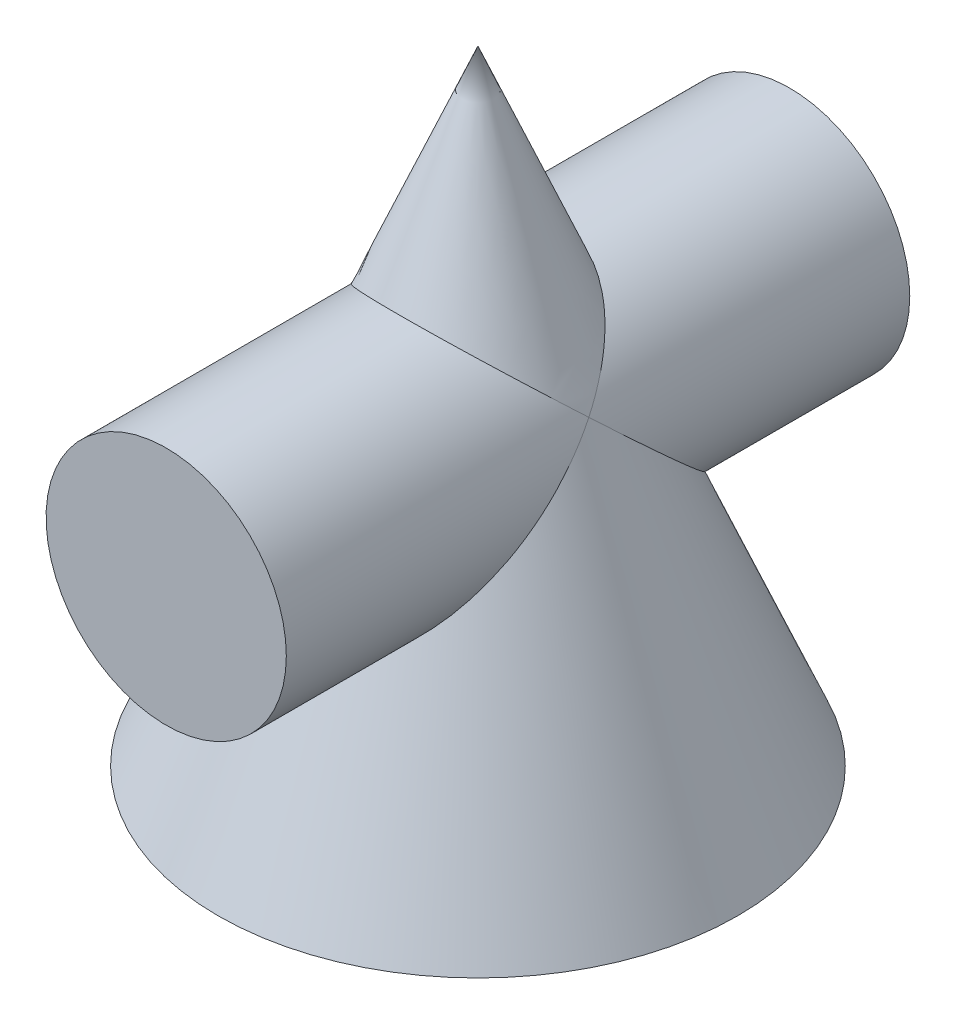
ISO-10303-21;
HEADER;
FILE_DESCRIPTION(('STEP AP214'),'2;1');
FILE_NAME('part.step','',(''),(''),'','','');
FILE_SCHEMA(('AUTOMOTIVE_DESIGN { 1 0 10303 214 1 1 1 1 }'));
ENDSEC;
DATA;
#1=APPLICATION_CONTEXT('core data for automotive mechanical design processes');
#2=APPLICATION_PROTOCOL_DEFINITION('international standard','automotive_design',2000,#1);
#3=PRODUCT_CONTEXT('',#1,'mechanical');
#4=PRODUCT('Part','Part','',(#3));
#5=PRODUCT_RELATED_PRODUCT_CATEGORY('part','',(#4));
#6=PRODUCT_DEFINITION_FORMATION('','',#4);
#7=PRODUCT_DEFINITION_CONTEXT('part definition',#1,'design');
#8=PRODUCT_DEFINITION('design','',#6,#7);
#9=PRODUCT_DEFINITION_SHAPE('','',#8);
#10=(LENGTH_UNIT() NAMED_UNIT(*) SI_UNIT(.MILLI.,.METRE.));
#11=(NAMED_UNIT(*) PLANE_ANGLE_UNIT() SI_UNIT($,.RADIAN.));
#12=(NAMED_UNIT(*) SI_UNIT($,.STERADIAN.) SOLID_ANGLE_UNIT());
#13=UNCERTAINTY_MEASURE_WITH_UNIT(LENGTH_MEASURE(1.E-05),#10,'distance_accuracy_value','');
#14=(GEOMETRIC_REPRESENTATION_CONTEXT(3) GLOBAL_UNCERTAINTY_ASSIGNED_CONTEXT((#13)) GLOBAL_UNIT_ASSIGNED_CONTEXT((#10,
#11,#12)) REPRESENTATION_CONTEXT('',''));
#15=CARTESIAN_POINT('',(0.,0.,0.));
#16=DIRECTION('',(0.,0.,1.));
#17=DIRECTION('',(1.,0.,0.));
#18=AXIS2_PLACEMENT_3D('',#15,#16,#17);
#19=CARTESIAN_POINT('',(0.,60.5117647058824,0.));
#20=DIRECTION('',(0.,-1.,0.));
#21=DIRECTION('',(0.,0.,-1.));
#22=AXIS2_PLACEMENT_3D('',#19,#20,#21);
#23=CONICAL_SURFACE('',#22,0.,0.394791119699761);
#24=CARTESIAN_POINT('',(0.,0.511764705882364,0.));
#25=DIRECTION('',(0.,1.,0.));
#26=DIRECTION('',(0.,0.,1.));
#27=AXIS2_PLACEMENT_3D('',#24,#25,#26);
#28=CIRCLE('',#27,25.);
#29=CARTESIAN_POINT('',(0.,0.511764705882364,25.));
#30=VERTEX_POINT('',#29);
#31=EDGE_CURVE('E66',#30,#30,#28,.T.);
#32=ORIENTED_EDGE('',*,*,#31,.T.);
#33=EDGE_LOOP('',(#32));
#34=FACE_BOUND('',#33,.T.);
#35=CARTESIAN_POINT('',(-10.6713621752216,34.9004954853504,0.));
#36=CARTESIAN_POINT('',(-10.6733116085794,34.8958168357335,0.00506853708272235));
#37=CARTESIAN_POINT('',(-10.6752577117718,34.891137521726,0.010137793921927));
#38=CARTESIAN_POINT('',(-10.854043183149,34.4604587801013,0.476706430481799));
#39=CARTESIAN_POINT('',(-11.003304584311,34.0289784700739,0.944143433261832));
#40=CARTESIAN_POINT('',(-11.24885767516,33.158946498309,1.88667806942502));
#41=CARTESIAN_POINT('',(-11.3451043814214,32.7203891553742,2.3617818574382));
#42=CARTESIAN_POINT('',(-11.4862680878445,31.8377644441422,3.31795862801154));
#43=CARTESIAN_POINT('',(-11.5309852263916,31.393682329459,3.79904758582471));
#44=CARTESIAN_POINT('',(-11.5690895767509,30.5046335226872,4.76218379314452));
#45=CARTESIAN_POINT('',(-11.5624890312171,30.0596670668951,5.24423078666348));
#46=CARTESIAN_POINT('',(-11.4965350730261,29.1527730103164,6.22669934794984));
#47=CARTESIAN_POINT('',(-11.434978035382,28.6909178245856,6.72704246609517));
#48=CARTESIAN_POINT('',(-11.2549932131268,27.7721603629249,7.72236304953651));
#49=CARTESIAN_POINT('',(-11.1365496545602,27.3152594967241,8.21733898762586));
#50=CARTESIAN_POINT('',(-10.841161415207,26.4114239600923,9.1964941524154));
#51=CARTESIAN_POINT('',(-10.6643679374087,25.9644666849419,9.68069786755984));
#52=CARTESIAN_POINT('',(-10.2492533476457,25.0839936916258,10.6345436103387));
#53=CARTESIAN_POINT('',(-10.0109729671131,24.6504692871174,11.1041950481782));
#54=CARTESIAN_POINT('',(-9.5777622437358,23.9729271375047,11.8381990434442));
#55=CARTESIAN_POINT('',(-9.40381407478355,23.7226817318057,12.1092982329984));
#56=CARTESIAN_POINT('',(-9.03139483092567,23.2306917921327,12.6422873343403));
#57=CARTESIAN_POINT('',(-8.83292564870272,22.9889466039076,12.9041779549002));
#58=CARTESIAN_POINT('',(-8.41059800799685,22.5161682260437,13.4163545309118));
#59=CARTESIAN_POINT('',(-8.18676434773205,22.2851248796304,13.6666514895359));
#60=CARTESIAN_POINT('',(-7.71249322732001,21.8359437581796,14.1532643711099));
#61=CARTESIAN_POINT('',(-7.46206238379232,21.6178027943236,14.3895837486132));
#62=CARTESIAN_POINT('',(-6.99738220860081,21.2480779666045,14.7901189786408));
#63=CARTESIAN_POINT('',(-6.78895577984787,21.0931224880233,14.9579874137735));
#64=CARTESIAN_POINT('',(-6.35597306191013,20.7939033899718,15.2821414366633));
#65=CARTESIAN_POINT('',(-6.13141736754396,20.6496393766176,15.438427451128));
#66=CARTESIAN_POINT('',(-5.66638982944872,20.3737427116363,15.7373155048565));
#67=CARTESIAN_POINT('',(-5.42593492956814,20.2420969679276,15.8799317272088));
#68=CARTESIAN_POINT('',(-4.92922616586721,19.9932973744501,16.1494646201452));
#69=CARTESIAN_POINT('',(-4.67297599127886,19.8761401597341,16.2763849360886));
#70=CARTESIAN_POINT('',(-4.20066157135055,19.681266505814,16.487498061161));
#71=CARTESIAN_POINT('',(-3.98739500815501,19.6004249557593,16.5750764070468));
#72=CARTESIAN_POINT('',(-3.55220457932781,19.4503113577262,16.7376994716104));
#73=CARTESIAN_POINT('',(-3.33028268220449,19.3810366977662,16.8127470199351));
#74=CARTESIAN_POINT('',(-2.8788434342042,19.2551844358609,16.9490869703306));
#75=CARTESIAN_POINT('',(-2.64932976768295,19.1986007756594,17.0103859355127));
#76=CARTESIAN_POINT('',(-2.18391563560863,19.0991141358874,17.1181631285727));
#77=CARTESIAN_POINT('',(-1.94801510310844,19.0562112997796,17.1646412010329));
#78=CARTESIAN_POINT('',(-1.46999800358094,18.9847306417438,17.242078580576));
#79=CARTESIAN_POINT('',(-1.22785212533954,18.9562425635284,17.2729406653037));
#80=CARTESIAN_POINT('',(-0.740695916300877,18.9146154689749,17.3180366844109));
#81=CARTESIAN_POINT('',(-0.495685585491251,18.9014764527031,17.3322706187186));
#82=CARTESIAN_POINT('',(-0.0049741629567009,18.8908491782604,17.3437834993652));
#83=CARTESIAN_POINT('',(0.240726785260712,18.893357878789,17.3410657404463));
#84=CARTESIAN_POINT('',(0.73069087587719,18.9139621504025,17.318744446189));
#85=CARTESIAN_POINT('',(0.974954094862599,18.9320568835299,17.2991418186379));
#86=CARTESIAN_POINT('',(1.43699237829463,18.9809839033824,17.2461375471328));
#87=CARTESIAN_POINT('',(1.65508617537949,19.0104483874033,17.2142176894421));
#88=CARTESIAN_POINT('',(2.08709822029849,19.0813023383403,17.137459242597));
#89=CARTESIAN_POINT('',(2.30101487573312,19.1226962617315,17.0926158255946));
#90=CARTESIAN_POINT('',(2.72338185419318,19.2167258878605,16.990750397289));
#91=CARTESIAN_POINT('',(2.93183238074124,19.2693611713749,16.9337288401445));
#92=CARTESIAN_POINT('',(3.34233525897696,19.3850951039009,16.8083504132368));
#93=CARTESIAN_POINT('',(3.54438633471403,19.4481958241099,16.7399912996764));
#94=CARTESIAN_POINT('',(4.00630822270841,19.6062632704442,16.5687515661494));
#95=CARTESIAN_POINT('',(4.26345988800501,19.70490021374,16.4618948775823));
#96=CARTESIAN_POINT('',(4.76394851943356,19.9171501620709,16.231957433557));
#97=CARTESIAN_POINT('',(5.00728175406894,20.0307671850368,16.1088723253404));
#98=CARTESIAN_POINT('',(5.47980173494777,20.2712363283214,15.8483640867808));
#99=CARTESIAN_POINT('',(5.70896712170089,20.3981076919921,15.7109201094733));
#100=CARTESIAN_POINT('',(6.15250743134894,20.6631867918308,15.4237510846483));
#101=CARTESIAN_POINT('',(6.36688156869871,20.8013951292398,15.2740253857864));
#102=CARTESIAN_POINT('',(6.86296272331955,21.1443317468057,14.9025107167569));
#103=CARTESIAN_POINT('',(7.13768945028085,21.3537174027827,14.6756762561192));
#104=CARTESIAN_POINT('',(7.65910917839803,21.787970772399,14.2052351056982));
#105=CARTESIAN_POINT('',(7.90579145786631,22.0128443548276,13.9616220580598));
#106=CARTESIAN_POINT('',(8.37239221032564,22.4754013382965,13.460518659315));
#107=CARTESIAN_POINT('',(8.59227558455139,22.7131009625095,13.2030107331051));
#108=CARTESIAN_POINT('',(9.00602244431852,23.1986315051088,12.6770193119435));
#109=CARTESIAN_POINT('',(9.19988587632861,23.4464624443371,12.4085357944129));
#110=CARTESIAN_POINT('',(9.64031046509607,24.0580535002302,11.7459788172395));
#111=CARTESIAN_POINT('',(9.87399064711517,24.4260980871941,11.3472638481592));
#112=CARTESIAN_POINT('',(10.2936283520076,25.1745294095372,10.5364632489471));
#113=CARTESIAN_POINT('',(10.4795656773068,25.5549212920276,10.124372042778));
#114=CARTESIAN_POINT('',(10.8062080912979,26.3249988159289,9.29012139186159));
#115=CARTESIAN_POINT('',(10.9468572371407,26.7146953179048,8.86795018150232));
#116=CARTESIAN_POINT('',(11.1843863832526,27.5000744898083,8.01712274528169));
#117=CARTESIAN_POINT('',(11.2812727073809,27.8957562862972,7.58846746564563));
#118=CARTESIAN_POINT('',(11.434750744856,28.702418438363,6.71458346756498));
#119=CARTESIAN_POINT('',(11.4900850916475,29.1135084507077,6.26923595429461));
#120=CARTESIAN_POINT('',(11.556482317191,29.9373876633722,5.37670014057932));
#121=CARTESIAN_POINT('',(11.5675378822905,30.3501771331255,4.92951154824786));
#122=CARTESIAN_POINT('',(11.5455299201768,31.1743757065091,4.0366297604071));
#123=CARTESIAN_POINT('',(11.5125553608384,31.5857859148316,3.59093536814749));
#124=CARTESIAN_POINT('',(11.4022206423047,32.4057208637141,2.70267250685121));
#125=CARTESIAN_POINT('',(11.3248808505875,32.814246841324,2.26010269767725));
#126=CARTESIAN_POINT('',(11.1556392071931,33.5010323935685,1.51608501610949));
#127=CARTESIAN_POINT('',(11.0755600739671,33.7806579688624,1.21315730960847));
#128=CARTESIAN_POINT('',(10.8931838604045,34.3364213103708,0.61108035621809));
#129=CARTESIAN_POINT('',(10.7909015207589,34.6125612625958,0.311928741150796));
#130=CARTESIAN_POINT('',(10.6752577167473,34.8911375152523,0.0101378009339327));
#131=CARTESIAN_POINT('',(10.6733116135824,34.8958168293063,0.00506854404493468));
#132=CARTESIAN_POINT('',(10.6713621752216,34.9004954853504,0.));
#133=B_SPLINE_CURVE_WITH_KNOTS('',3,(#35,#36,#37,#38,#39,#40,#41,#42,#43,#44,#45,#46,#47,#48,
#49,#50,#51,#52,#53,#54,#55,#56,#57,#58,#59,#60,#61,#62,#63,#64,#65,#66,#67,#68,#69,#70,#71,#72,
#73,#74,#75,#76,#77,#78,#79,#80,#81,#82,#83,#84,#85,#86,#87,#88,#89,#90,#91,#92,#93,#94,#95,#96,
#97,#98,#99,#100,#101,#102,#103,#104,#105,#106,#107,#108,#109,#110,#111,#112,#113,#114,#115,
#116,#117,#118,#119,#120,#121,#122,#123,#124,#125,#126,#127,#128,#129,#130,#131,#132),
.UNSPECIFIED.,.F.,.F.,(4,2,2,2,2,2,2,2,2,2,2,2,2,2,2,2,2,2,2,2,2,2,2,2,2,2,2,2,2,2,2,2,2,2,2,2,
2,2,2,2,2,2,2,2,2,2,2,2,4),(0.,0.0215040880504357,1.97893203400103,3.93801832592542,
5.90467778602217,7.87086808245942,9.91962510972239,11.9689505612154,14.0130067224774,
16.0557122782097,17.2786045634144,18.5014025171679,19.7230151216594,20.9443245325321,
21.8713363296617,22.7983139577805,23.7243191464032,24.6501088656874,25.3823632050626,
26.1144519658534,26.8461905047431,27.5779367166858,28.3141842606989,29.0504318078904,
29.7865362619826,30.5226011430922,31.1889934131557,31.8556349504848,32.5222516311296,
33.1890003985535,34.0739649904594,34.9591674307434,35.8456734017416,36.7322264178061,
37.970086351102,39.2084179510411,40.4483543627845,41.6882933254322,43.4580812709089,
45.2286166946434,47.0013308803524,48.7737888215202,50.5979313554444,52.422375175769,
54.2431380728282,56.0630657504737,57.3224310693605,58.5809628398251,58.6024669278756),.UNSPECIFIED.);
#134=CARTESIAN_POINT('',(10.6713621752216,34.9004954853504,0.));
#135=VERTEX_POINT('',#134);
#136=CARTESIAN_POINT('',(-10.6713621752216,34.9004954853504,0.));
#137=VERTEX_POINT('',#136);
#138=EDGE_CURVE('E47',#135,#137,#133,.F.);
#139=ORIENTED_EDGE('',*,*,#138,.T.);
#140=CARTESIAN_POINT('',(-10.6713621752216,34.9004954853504,0.));
#141=CARTESIAN_POINT('',(-10.6733116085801,34.8958168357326,-0.00506853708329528));
#142=CARTESIAN_POINT('',(-10.6752577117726,34.8911375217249,-0.0101377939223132));
#143=CARTESIAN_POINT('',(-10.8540343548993,34.4604800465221,-0.476683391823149));
#144=CARTESIAN_POINT('',(-11.0032896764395,34.0290215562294,-0.944096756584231));
#145=CARTESIAN_POINT('',(-11.2488358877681,33.1590334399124,-1.88658388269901));
#146=CARTESIAN_POINT('',(-11.3450817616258,32.7204981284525,-2.36166380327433));
#147=CARTESIAN_POINT('',(-11.4862559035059,31.837873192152,-3.3178408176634));
#148=CARTESIAN_POINT('',(-11.5309791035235,31.3937684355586,-3.79895430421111));
#149=CARTESIAN_POINT('',(-11.5690901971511,30.5046757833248,-4.76213801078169));
#150=CARTESIAN_POINT('',(-11.5624905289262,30.0596881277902,-5.24420797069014));
#151=CARTESIAN_POINT('',(-11.4965260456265,29.1526483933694,-6.22683434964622));
#152=CARTESIAN_POINT('',(-11.4349450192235,28.6906691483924,-6.72731186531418));
#153=CARTESIAN_POINT('',(-11.2548792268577,27.7716587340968,-7.72290648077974));
#154=CARTESIAN_POINT('',(-11.1363777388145,27.3146290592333,-8.21802196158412));
#155=CARTESIAN_POINT('',(-10.8409190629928,26.4107866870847,-9.19718453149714));
#156=CARTESIAN_POINT('',(-10.6641443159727,25.9639466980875,-9.68126118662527));
#157=CARTESIAN_POINT('',(-10.2491032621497,25.0837210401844,-10.6348389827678));
#158=CARTESIAN_POINT('',(-10.0108816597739,24.6503258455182,-11.1043504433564));
#159=CARTESIAN_POINT('',(-9.59327362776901,23.9971873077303,-11.8119171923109));
#160=CARTESIAN_POINT('',(-9.43697409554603,23.7705747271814,-12.0574141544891));
#161=CARTESIAN_POINT('',(-9.10442870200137,23.3242082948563,-12.5409777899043));
#162=CARTESIAN_POINT('',(-8.92818781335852,23.1044527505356,-12.7790462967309));
#163=CARTESIAN_POINT('',(-8.55503764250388,22.6732825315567,-13.2461473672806));
#164=CARTESIAN_POINT('',(-8.35813790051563,22.4618640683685,-13.4751840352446));
#165=CARTESIAN_POINT('',(-7.94279917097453,22.0489698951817,-13.9224860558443));
#166=CARTESIAN_POINT('',(-7.72436253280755,21.84749310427,-14.1407525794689));
#167=CARTESIAN_POINT('',(-7.30355968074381,21.489187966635,-14.5289164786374));
#168=CARTESIAN_POINT('',(-7.10459756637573,21.330520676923,-14.7008060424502));
#169=CARTESIAN_POINT('',(-6.69087703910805,21.0229201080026,-15.0340399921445));
#170=CARTESIAN_POINT('',(-6.47611886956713,20.873986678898,-15.1953845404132));
#171=CARTESIAN_POINT('',(-6.0307825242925,20.5875774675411,-15.5056611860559));
#172=CARTESIAN_POINT('',(-5.80021386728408,20.4500948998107,-15.6546006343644));
#173=CARTESIAN_POINT('',(-5.32329498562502,20.188378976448,-15.9381262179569));
#174=CARTESIAN_POINT('',(-5.07694959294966,20.0641415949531,-16.072716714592));
#175=CARTESIAN_POINT('',(-4.61422639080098,19.8517301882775,-16.3028290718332));
#176=CARTESIAN_POINT('',(-4.40032400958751,19.7610738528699,-16.4010401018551));
#177=CARTESIAN_POINT('',(-3.96285757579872,19.5913504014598,-16.5849071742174));
#178=CARTESIAN_POINT('',(-3.73929887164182,19.5122769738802,-16.6705700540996));
#179=CARTESIAN_POINT('',(-3.28336166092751,19.366930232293,-16.8280290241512));
#180=CARTESIAN_POINT('',(-3.05098582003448,19.3006530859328,-16.8998292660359));
#181=CARTESIAN_POINT('',(-2.57857924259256,19.1820638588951,-17.0283009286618));
#182=CARTESIAN_POINT('',(-2.33854847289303,19.1297518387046,-17.0849722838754));
#183=CARTESIAN_POINT('',(-1.8506027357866,19.0398176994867,-17.1824009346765));
#184=CARTESIAN_POINT('',(-1.60264195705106,19.002309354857,-17.2230349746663));
#185=CARTESIAN_POINT('',(-1.10257519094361,18.94339720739,-17.2868564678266));
#186=CARTESIAN_POINT('',(-0.850469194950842,18.9219934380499,-17.3100438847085));
#187=CARTESIAN_POINT('',(-0.344480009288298,18.895810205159,-17.3384090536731));
#188=CARTESIAN_POINT('',(-0.0905975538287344,18.8910242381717,-17.3435938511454));
#189=CARTESIAN_POINT('',(0.416640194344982,18.8981791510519,-17.3358426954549));
#190=CARTESIAN_POINT('',(0.669995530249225,18.910118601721,-17.3229082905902));
#191=CARTESIAN_POINT('',(1.14370249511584,18.9480117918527,-17.2818573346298));
#192=CARTESIAN_POINT('',(1.36438082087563,18.972120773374,-17.2557392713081));
#193=CARTESIAN_POINT('',(1.80211913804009,19.0326388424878,-17.1901780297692));
#194=CARTESIAN_POINT('',(2.01917776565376,19.0690524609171,-17.1507299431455));
#195=CARTESIAN_POINT('',(2.44826753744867,19.1535523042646,-17.0591884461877));
#196=CARTESIAN_POINT('',(2.66029897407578,19.2016378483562,-17.0070957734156));
#197=CARTESIAN_POINT('',(3.0782949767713,19.3087311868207,-16.891077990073));
#198=CARTESIAN_POINT('',(3.28425831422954,19.3677411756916,-16.8271505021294));
#199=CARTESIAN_POINT('',(3.74727030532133,19.5142113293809,-16.6684745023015));
#200=CARTESIAN_POINT('',(4.00205257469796,19.6049790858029,-16.5701427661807));
#201=CARTESIAN_POINT('',(4.49883095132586,19.8013779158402,-16.3573773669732));
#202=CARTESIAN_POINT('',(4.74082403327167,19.9070124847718,-16.242939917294));
#203=CARTESIAN_POINT('',(5.21152579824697,20.13147280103,-15.99977457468));
#204=CARTESIAN_POINT('',(5.44021766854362,20.2503147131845,-15.8710291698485));
#205=CARTESIAN_POINT('',(5.88368189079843,20.4994244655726,-15.6011602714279));
#206=CARTESIAN_POINT('',(6.09845010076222,20.6296956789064,-15.4600331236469));
#207=CARTESIAN_POINT('',(6.59402830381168,20.9522440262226,-15.1106057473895));
#208=CARTESIAN_POINT('',(6.86841025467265,21.1490762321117,-14.8973708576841));
#209=CARTESIAN_POINT('',(7.39062443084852,21.5581861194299,-14.4541684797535));
#210=CARTESIAN_POINT('',(7.63845720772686,21.7704634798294,-14.2242013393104));
#211=CARTESIAN_POINT('',(8.10884816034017,22.207983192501,-13.7502216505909));
#212=CARTESIAN_POINT('',(8.33136697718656,22.4332449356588,-13.5061880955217));
#213=CARTESIAN_POINT('',(8.75167656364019,22.8940767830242,-13.0069535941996));
#214=CARTESIAN_POINT('',(8.94946716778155,23.1296469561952,-12.7517525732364));
#215=CARTESIAN_POINT('',(9.4021659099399,23.7133804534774,-12.1193746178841));
#216=CARTESIAN_POINT('',(9.64458227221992,24.0660175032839,-11.7373511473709));
#217=CARTESIAN_POINT('',(10.0835576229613,24.7842156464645,-10.959303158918));
#218=CARTESIAN_POINT('',(10.280096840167,25.1497822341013,-10.5632726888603));
#219=CARTESIAN_POINT('',(10.6297888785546,25.8907584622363,-9.76054844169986));
#220=CARTESIAN_POINT('',(10.7828913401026,26.2661789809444,-9.35384287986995));
#221=CARTESIAN_POINT('',(11.0472301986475,27.0236376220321,-8.53326268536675));
#222=CARTESIAN_POINT('',(11.1584725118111,27.4056748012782,-8.11938907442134));
#223=CARTESIAN_POINT('',(11.3433402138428,28.1862763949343,-7.27373734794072));
#224=CARTESIAN_POINT('',(11.41566696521,28.584981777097,-6.84180651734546));
#225=CARTESIAN_POINT('',(11.5181566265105,29.3849183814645,-5.97520852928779));
#226=CARTESIAN_POINT('',(11.5483135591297,29.7861499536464,-5.54054099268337));
#227=CARTESIAN_POINT('',(11.5668117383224,30.5883822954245,-4.671455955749));
#228=CARTESIAN_POINT('',(11.5552224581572,30.9893823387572,-4.23703924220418));
#229=CARTESIAN_POINT('',(11.4902450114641,31.7896985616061,-3.37003000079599));
#230=CARTESIAN_POINT('',(11.4368721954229,32.1890153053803,-2.93743686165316));
#231=CARTESIAN_POINT('',(11.2975678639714,32.9312888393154,-2.13330719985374));
#232=CARTESIAN_POINT('',(11.2168866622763,33.2747036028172,-1.76127453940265));
#233=CARTESIAN_POINT('',(11.0228614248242,33.9570456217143,-1.02207068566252));
#234=CARTESIAN_POINT('',(10.9095443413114,34.2959763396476,-0.654895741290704));
#235=CARTESIAN_POINT('',(10.7464056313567,34.7169031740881,-0.19889167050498));
#236=CARTESIAN_POINT('',(10.7123503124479,34.8017844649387,-0.106936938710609));
#237=CARTESIAN_POINT('',(10.6752577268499,34.8911374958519,-0.0101378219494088));
#238=CARTESIAN_POINT('',(10.6733116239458,34.8958168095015,-0.00506856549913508));
#239=CARTESIAN_POINT('',(10.6713621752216,34.9004954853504,0.));
#240=B_SPLINE_CURVE_WITH_KNOTS('',3,(#140,#141,#142,#143,#144,#145,#146,#147,#148,#149,#150,
#151,#152,#153,#154,#155,#156,#157,#158,#159,#160,#161,#162,#163,#164,#165,#166,#167,#168,#169,
#170,#171,#172,#173,#174,#175,#176,#177,#178,#179,#180,#181,#182,#183,#184,#185,#186,#187,#188,
#189,#190,#191,#192,#193,#194,#195,#196,#197,#198,#199,#200,#201,#202,#203,#204,#205,#206,#207,
#208,#209,#210,#211,#212,#213,#214,#215,#216,#217,#218,#219,#220,#221,#222,#223,#224,#225,#226,
#227,#228,#229,#230,#231,#232,#233,#234,#235,#236,#237,#238,#239),.UNSPECIFIED.,.F.,.F.,(4,2,2,
2,2,2,2,2,2,2,2,2,2,2,2,2,2,2,2,2,2,2,2,2,2,2,2,2,2,2,2,2,2,2,2,2,2,2,2,2,2,2,2,2,2,2,2,2,2,4),
(0.,0.0215040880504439,1.97883431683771,3.93782416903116,5.90458444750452,7.87086809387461,
9.92017693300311,11.9700881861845,14.0136416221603,16.0557124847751,17.1617069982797,
18.2674263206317,19.3726372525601,20.4777277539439,21.3983481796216,22.3189544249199,
23.2390112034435,24.1587875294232,24.9147727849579,25.6703445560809,26.4256896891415,
27.1810380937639,27.9420837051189,28.7031308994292,29.4638802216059,30.2245645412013,
30.8943672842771,31.5644169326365,32.2344275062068,32.9045728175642,33.766678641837,
34.6289874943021,35.4923636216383,36.3559954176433,37.5523002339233,38.7485801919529,
39.9466954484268,41.1448187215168,42.8631965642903,44.5823135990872,46.3034156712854,
48.0242744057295,49.7994683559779,51.5749139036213,53.3474061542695,55.1192475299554,
56.6563480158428,58.1921827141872,58.5812504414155,58.602754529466),.UNSPECIFIED.);
#241=EDGE_CURVE('E11',#137,#135,#240,.T.);
#242=ORIENTED_EDGE('',*,*,#241,.T.);
#243=EDGE_LOOP('',(#139,#242));
#244=FACE_BOUND('',#243,.T.);
#245=ADVANCED_FACE('F30',(#34,#244),#23,.T.);
#246=CARTESIAN_POINT('',(-25.,0.511764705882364,0.));
#247=DIRECTION('',(0.,-1.,0.));
#248=DIRECTION('',(0.,0.,-1.));
#249=AXIS2_PLACEMENT_3D('',#246,#247,#248);
#250=PLANE('',#249);
#251=ORIENTED_EDGE('',*,*,#31,.F.);
#252=EDGE_LOOP('',(#251));
#253=FACE_BOUND('',#252,.T.);
#254=ADVANCED_FACE('F80',(#253),#250,.T.);
#255=CARTESIAN_POINT('',(0.,30.4540945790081,30.));
#256=DIRECTION('',(0.,0.,1.));
#257=DIRECTION('',(1.,0.,0.));
#258=AXIS2_PLACEMENT_3D('',#255,#256,#257);
#259=PLANE('',#258);
#260=CARTESIAN_POINT('',(0.,30.4540945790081,30.));
#261=DIRECTION('',(0.,0.,1.));
#262=DIRECTION('',(1.,0.,0.));
#263=AXIS2_PLACEMENT_3D('',#260,#261,#262);
#264=CIRCLE('',#263,11.5606423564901);
#265=CARTESIAN_POINT('',(11.5606423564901,30.4540945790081,30.));
#266=VERTEX_POINT('',#265);
#267=EDGE_CURVE('E90',#266,#266,#264,.T.);
#268=ORIENTED_EDGE('',*,*,#267,.T.);
#269=EDGE_LOOP('',(#268));
#270=FACE_BOUND('',#269,.T.);
#271=ADVANCED_FACE('F97',(#270),#259,.T.);
#272=CARTESIAN_POINT('',(0.,30.4540945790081,30.));
#273=DIRECTION('',(0.,0.,-1.));
#274=DIRECTION('',(-1.,0.,0.));
#275=AXIS2_PLACEMENT_3D('',#272,#273,#274);
#276=CYLINDRICAL_SURFACE('',#275,11.5606423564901);
#277=CARTESIAN_POINT('',(-10.6713621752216,34.9004954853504,0.));
#278=CARTESIAN_POINT('',(-10.6694127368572,34.9051741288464,0.00506853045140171));
#279=CARTESIAN_POINT('',(-10.6674599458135,34.9098521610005,0.0101363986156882));
#280=CARTESIAN_POINT('',(-10.5101923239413,35.2859010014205,0.417522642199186));
#281=CARTESIAN_POINT('',(-10.3337338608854,35.6533970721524,0.815643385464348));
#282=CARTESIAN_POINT('',(-9.93640833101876,36.3775229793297,1.60011311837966));
#283=CARTESIAN_POINT('',(-9.71550369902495,36.7341433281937,1.98645182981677));
#284=CARTESIAN_POINT('',(-9.22662309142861,37.4326143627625,2.74312878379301));
#285=CARTESIAN_POINT('',(-8.95861711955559,37.7744554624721,3.11345664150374));
#286=CARTESIAN_POINT('',(-8.3728622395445,38.4377733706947,3.83205104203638));
#287=CARTESIAN_POINT('',(-8.05516469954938,38.7592707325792,4.18033985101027));
#288=CARTESIAN_POINT('',(-7.52312855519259,39.2355916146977,4.69635414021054));
#289=CARTESIAN_POINT('',(-7.32717391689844,39.3999366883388,4.87439463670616));
#290=CARTESIAN_POINT('',(-6.9190556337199,39.7192038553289,5.22026740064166));
#291=CARTESIAN_POINT('',(-6.70688922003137,39.8741243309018,5.38809791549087));
#292=CARTESIAN_POINT('',(-6.26650697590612,40.1726331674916,5.71148248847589));
#293=CARTESIAN_POINT('',(-6.03831702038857,40.3162390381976,5.86705551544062));
#294=CARTESIAN_POINT('',(-5.5656943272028,40.5904682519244,6.16413716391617));
#295=CARTESIAN_POINT('',(-5.32127087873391,40.7210989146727,6.30565371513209));
#296=CARTESIAN_POINT('',(-4.86040643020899,40.9459350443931,6.54922618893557));
#297=CARTESIAN_POINT('',(-4.64649226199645,41.042524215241,6.653864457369));
#298=CARTESIAN_POINT('',(-4.20836115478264,41.2241615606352,6.85063824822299));
#299=CARTESIAN_POINT('',(-3.98414929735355,41.3092153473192,6.9427798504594));
#300=CARTESIAN_POINT('',(-3.52614036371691,41.4665149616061,7.11318776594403));
#301=CARTESIAN_POINT('',(-3.29234373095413,41.5387613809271,7.19145472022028));
#302=CARTESIAN_POINT('',(-2.81631935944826,41.6691596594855,7.33271952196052));
#303=CARTESIAN_POINT('',(-2.57409158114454,41.7273114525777,7.3957172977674));
#304=CARTESIAN_POINT('',(-2.08074513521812,41.8287541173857,7.50561351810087));
#305=CARTESIAN_POINT('',(-1.82956959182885,41.8719183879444,7.55237481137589));
#306=CARTESIAN_POINT('',(-1.3222505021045,41.941725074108,7.62799872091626));
#307=CARTESIAN_POINT('',(-1.06610693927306,41.968367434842,7.65686127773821));
#308=CARTESIAN_POINT('',(-0.551332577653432,42.00446341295,7.69596525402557));
#309=CARTESIAN_POINT('',(-0.292703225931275,42.0139264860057,7.70621691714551));
#310=CARTESIAN_POINT('',(0.224650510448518,42.0154472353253,7.70786439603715));
#311=CARTESIAN_POINT('',(0.483374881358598,42.007506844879,7.69926230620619));
#312=CARTESIAN_POINT('',(0.964314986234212,41.9766254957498,7.66580751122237));
#313=CARTESIAN_POINT('',(1.18683419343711,41.9558070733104,7.64325422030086));
#314=CARTESIAN_POINT('',(1.62849894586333,41.9016240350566,7.58455592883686));
#315=CARTESIAN_POINT('',(1.84764485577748,41.8682607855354,7.54841240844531));
#316=CARTESIAN_POINT('',(2.28121827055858,41.7895722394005,7.4631664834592));
#317=CARTESIAN_POINT('',(2.49564536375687,41.7442459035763,7.4140629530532));
#318=CARTESIAN_POINT('',(2.91861584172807,41.6423680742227,7.30369530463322));
#319=CARTESIAN_POINT('',(3.12715885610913,41.5858158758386,7.24243042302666));
#320=CARTESIAN_POINT('',(3.54500045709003,41.460037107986,7.10617009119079));
#321=CARTESIAN_POINT('',(3.75404271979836,41.3904197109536,7.03075124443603));
#322=CARTESIAN_POINT('',(4.16408235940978,41.2409621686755,6.86883890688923));
#323=CARTESIAN_POINT('',(4.3650771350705,41.1611187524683,6.78234187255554));
#324=CARTESIAN_POINT('',(4.75845443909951,40.9921869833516,6.59933245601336));
#325=CARTESIAN_POINT('',(4.95083576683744,40.9030973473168,6.5028186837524));
#326=CARTESIAN_POINT('',(5.32663439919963,40.7166203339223,6.30080191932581));
#327=CARTESIAN_POINT('',(5.51005075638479,40.6192320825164,6.19529798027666));
#328=CARTESIAN_POINT('',(5.97298118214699,40.3575487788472,5.91180773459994));
#329=CARTESIAN_POINT('',(6.24557391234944,40.1875885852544,5.72768419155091));
#330=CARTESIAN_POINT('',(6.76763918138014,39.8321178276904,5.34259087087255));
#331=CARTESIAN_POINT('',(7.01710686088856,39.6466040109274,5.14161756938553));
#332=CARTESIAN_POINT('',(7.49397808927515,39.2622023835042,4.72518247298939));
#333=CARTESIAN_POINT('',(7.72132418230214,39.0632819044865,4.50968528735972));
#334=CARTESIAN_POINT('',(8.15390042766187,38.6547570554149,4.0671167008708));
#335=CARTESIAN_POINT('',(8.35913267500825,38.4451537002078,3.84004639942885));
#336=CARTESIAN_POINT('',(8.78765240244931,37.9738377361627,3.32945410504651));
#337=CARTESIAN_POINT('',(9.00621592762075,37.7101501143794,3.04379251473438));
#338=CARTESIAN_POINT('',(9.41408127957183,37.1725321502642,2.46137305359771));
#339=CARTESIAN_POINT('',(9.60337479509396,36.8985989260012,2.16461206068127));
#340=CARTESIAN_POINT('',(9.95363872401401,36.3431634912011,1.56289033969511));
#341=CARTESIAN_POINT('',(10.1146604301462,36.0616760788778,1.25794564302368));
#342=CARTESIAN_POINT('',(10.4099157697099,35.4924314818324,0.641263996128));
#343=CARTESIAN_POINT('',(10.5441609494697,35.2046770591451,0.329530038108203));
#344=CARTESIAN_POINT('',(10.6674599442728,34.9098521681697,0.0101364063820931));
#345=CARTESIAN_POINT('',(10.6694127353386,34.9051741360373,0.00506853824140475));
#346=CARTESIAN_POINT('',(10.6713621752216,34.9004954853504,0.));
#347=B_SPLINE_CURVE_WITH_KNOTS('',3,(#277,#278,#279,#280,#281,#282,#283,#284,#285,#286,#287,
#288,#289,#290,#291,#292,#293,#294,#295,#296,#297,#298,#299,#300,#301,#302,#303,#304,#305,#306,
#307,#308,#309,#310,#311,#312,#313,#314,#315,#316,#317,#318,#319,#320,#321,#322,#323,#324,#325,
#326,#327,#328,#329,#330,#331,#332,#333,#334,#335,#336,#337,#338,#339,#340,#341,#342,#343,#344,
#345,#346),.UNSPECIFIED.,.F.,.F.,(4,2,2,2,2,2,2,2,2,2,2,2,2,2,2,2,2,2,2,2,2,2,2,2,2,2,2,2,2,2,2,
2,2,2,4),(0.,0.0215040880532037,1.72885733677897,3.43765972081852,5.14755431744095,
6.85569287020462,7.78994124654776,8.72434954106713,9.6572821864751,10.5896855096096,
11.3599223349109,12.129783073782,12.8996082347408,13.6694370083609,14.4456188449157,
15.2218032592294,15.9975603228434,16.7732312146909,17.4463271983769,18.1193498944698,
18.7924310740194,19.4655545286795,20.1635277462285,20.8617247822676,21.5600188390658,
22.2583865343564,23.3674626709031,24.4767713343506,25.5888882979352,26.7008998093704,
28.0374830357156,29.3744450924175,30.7089558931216,32.0428899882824,32.0643940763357),.UNSPECIFIED.);
#348=EDGE_CURVE('E42',#137,#135,#347,.T.);
#349=ORIENTED_EDGE('',*,*,#348,.F.);
#350=ORIENTED_EDGE('',*,*,#138,.F.);
#351=EDGE_LOOP('',(#349,#350));
#352=FACE_BOUND('',#351,.T.);
#353=ORIENTED_EDGE('',*,*,#267,.F.);
#354=EDGE_LOOP('',(#353));
#355=FACE_BOUND('',#354,.T.);
#356=ADVANCED_FACE('F64',(#352,#355),#276,.T.);
#357=CARTESIAN_POINT('',(0.,60.5117647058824,0.));
#358=VERTEX_POINT('',#357);
#359=VERTEX_LOOP('',#358);
#360=FACE_BOUND('',#359,.T.);
#361=CARTESIAN_POINT('',(10.6713621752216,34.9004954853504,0.));
#362=CARTESIAN_POINT('',(10.6694127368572,34.9051741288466,-0.00506853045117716));
#363=CARTESIAN_POINT('',(10.6674599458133,34.9098521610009,-0.0101363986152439));
#364=CARTESIAN_POINT('',(10.5101923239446,35.2859010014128,-0.417522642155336));
#365=CARTESIAN_POINT('',(10.3337338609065,35.6533970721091,-0.815643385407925));
#366=CARTESIAN_POINT('',(9.93640833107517,36.3775229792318,-1.6001131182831));
#367=CARTESIAN_POINT('',(9.71550369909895,36.7341433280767,-1.98645182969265));
#368=CARTESIAN_POINT('',(9.22662309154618,37.4326143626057,-2.74312878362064));
#369=CARTESIAN_POINT('',(8.95861711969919,37.7744554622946,-3.11345664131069));
#370=CARTESIAN_POINT('',(8.37286223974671,38.4377733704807,-3.83205104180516));
#371=CARTESIAN_POINT('',(8.05516469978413,38.7592707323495,-4.18033985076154));
#372=CARTESIAN_POINT('',(7.52312855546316,39.2355916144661,-4.69635413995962));
#373=CARTESIAN_POINT('',(7.32717391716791,39.3999366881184,-4.8743946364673));
#374=CARTESIAN_POINT('',(6.9190556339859,39.7192038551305,-5.22026740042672));
#375=CARTESIAN_POINT('',(6.706889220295,39.8741243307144,-5.38809791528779));
#376=CARTESIAN_POINT('',(6.26650697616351,40.1726331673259,-5.71148248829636));
#377=CARTESIAN_POINT('',(6.03831702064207,40.3162390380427,-5.86705551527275));
#378=CARTESIAN_POINT('',(5.56569432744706,40.5904682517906,-6.16413716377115));
#379=CARTESIAN_POINT('',(5.3212708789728,40.7210989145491,-6.30565371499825));
#380=CARTESIAN_POINT('',(4.86040643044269,40.9459350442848,-6.54922618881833));
#381=CARTESIAN_POINT('',(4.64649226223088,41.0425242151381,-6.65386445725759));
#382=CARTESIAN_POINT('',(4.20836115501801,41.2241615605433,-6.85063824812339));
#383=CARTESIAN_POINT('',(3.98414929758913,41.3092153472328,-6.94277985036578));
#384=CARTESIAN_POINT('',(3.52614036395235,41.4665149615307,-7.1131877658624));
#385=CARTESIAN_POINT('',(3.29234373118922,41.5387613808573,-7.19145472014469));
#386=CARTESIAN_POINT('',(2.81631935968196,41.6691596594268,-7.33271952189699));
#387=CARTESIAN_POINT('',(2.5740915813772,41.7273114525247,-7.3957172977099));
#388=CARTESIAN_POINT('',(2.08074513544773,41.8287541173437,-7.50561351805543));
#389=CARTESIAN_POINT('',(1.82956959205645,41.871918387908,-7.55237481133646));
#390=CARTESIAN_POINT('',(1.32225050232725,41.9417250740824,-7.62799872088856));
#391=CARTESIAN_POINT('',(1.06610693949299,41.9683674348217,-7.65686127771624));
#392=CARTESIAN_POINT('',(0.551332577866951,42.0044634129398,-7.69596525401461));
#393=CARTESIAN_POINT('',(0.29270322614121,42.0139264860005,-7.70621691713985));
#394=CARTESIAN_POINT('',(-0.22465051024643,42.0154472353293,-7.7078643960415));
#395=CARTESIAN_POINT('',(-0.48337488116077,42.0075068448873,-7.69926230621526));
#396=CARTESIAN_POINT('',(-0.964314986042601,41.9766254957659,-7.66580751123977));
#397=CARTESIAN_POINT('',(-1.18683419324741,41.95580707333,-7.6432542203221));
#398=CARTESIAN_POINT('',(-1.62849894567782,41.901624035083,-7.58455592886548));
#399=CARTESIAN_POINT('',(-1.84764485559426,41.868260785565,-7.54841240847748));
#400=CARTESIAN_POINT('',(-2.28121827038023,41.7895722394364,-7.46316648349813));
#401=CARTESIAN_POINT('',(-2.4956453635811,41.7442459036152,-7.41406295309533));
#402=CARTESIAN_POINT('',(-2.91861584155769,41.6423680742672,-7.30369530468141));
#403=CARTESIAN_POINT('',(-3.12715885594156,41.5858158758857,-7.24243042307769));
#404=CARTESIAN_POINT('',(-3.54500045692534,41.460037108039,-7.10617009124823));
#405=CARTESIAN_POINT('',(-3.75404271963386,41.3904197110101,-7.03075124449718));
#406=CARTESIAN_POINT('',(-4.16408235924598,41.2409621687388,-6.86883890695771));
#407=CARTESIAN_POINT('',(-4.3650771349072,41.1611187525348,-6.78234187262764));
#408=CARTESIAN_POINT('',(-4.75845443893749,40.9921869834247,-6.5993324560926));
#409=CARTESIAN_POINT('',(-4.9508357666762,40.9030973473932,-6.50281868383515));
#410=CARTESIAN_POINT('',(-5.32663439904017,40.7166203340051,-6.30080191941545));
#411=CARTESIAN_POINT('',(-5.51005075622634,40.6192320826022,-6.19529798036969));
#412=CARTESIAN_POINT('',(-5.9729811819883,40.3575487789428,-5.91180773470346));
#413=CARTESIAN_POINT('',(-6.2455739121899,40.1875885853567,-5.72768419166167));
#414=CARTESIAN_POINT('',(-6.76763918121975,39.832117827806,-5.34259087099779));
#415=CARTESIAN_POINT('',(-7.01710686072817,39.6466040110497,-5.14161756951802));
#416=CARTESIAN_POINT('',(-7.4939780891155,39.2622023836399,-4.72518247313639));
#417=CARTESIAN_POINT('',(-7.72132418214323,39.0632819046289,-4.50968528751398));
#418=CARTESIAN_POINT('',(-8.15390042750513,38.6547570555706,-4.06711670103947));
#419=CARTESIAN_POINT('',(-8.35913267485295,38.4451537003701,-3.84004639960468));
#420=CARTESIAN_POINT('',(-8.78765240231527,37.9738377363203,-3.32945410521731));
#421=CARTESIAN_POINT('',(-9.00621592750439,37.7101501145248,-3.04379251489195));
#422=CARTESIAN_POINT('',(-9.41408127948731,37.1725321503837,-2.46137305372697));
#423=CARTESIAN_POINT('',(-9.60337479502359,36.8985989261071,-2.16461206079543));
#424=CARTESIAN_POINT('',(-9.95363872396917,36.3431634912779,-1.56289033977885));
#425=CARTESIAN_POINT('',(-10.1146604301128,36.061676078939,-1.2579456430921));
#426=CARTESIAN_POINT('',(-10.4099157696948,35.492431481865,-0.641263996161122));
#427=CARTESIAN_POINT('',(-10.5441609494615,35.2046770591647,-0.329530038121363));
#428=CARTESIAN_POINT('',(-10.6674599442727,34.9098521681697,-0.010136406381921));
#429=CARTESIAN_POINT('',(-10.6694127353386,34.9051741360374,-0.00506853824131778));
#430=CARTESIAN_POINT('',(-10.6713621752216,34.9004954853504,0.));
#431=B_SPLINE_CURVE_WITH_KNOTS('',3,(#361,#362,#363,#364,#365,#366,#367,#368,#369,#370,#371,
#372,#373,#374,#375,#376,#377,#378,#379,#380,#381,#382,#383,#384,#385,#386,#387,#388,#389,#390,
#391,#392,#393,#394,#395,#396,#397,#398,#399,#400,#401,#402,#403,#404,#405,#406,#407,#408,#409,
#410,#411,#412,#413,#414,#415,#416,#417,#418,#419,#420,#421,#422,#423,#424,#425,#426,#427,#428,
#429,#430),.UNSPECIFIED.,.F.,.F.,(4,2,2,2,2,2,2,2,2,2,2,2,2,2,2,2,2,2,2,2,2,2,2,2,2,2,2,2,2,2,2,
2,2,2,4),(0.,0.0215040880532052,1.72885733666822,3.4376597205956,5.14755431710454,
6.85569286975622,7.78994124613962,8.72434954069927,9.65728218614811,10.5896855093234,
11.3599223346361,12.1297830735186,12.8996082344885,13.6694370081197,14.4456188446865,
15.221803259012,15.9975603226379,16.7732312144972,17.4463271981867,18.1193498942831,
18.7924310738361,19.4655545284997,20.1635277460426,20.8617247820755,21.5600188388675,
22.258386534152,23.3674626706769,24.4767713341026,25.5888882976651,26.7008998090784,
28.0374830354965,29.3744450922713,30.7089558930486,32.0428899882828,32.064394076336),.UNSPECIFIED.);
#432=EDGE_CURVE('E57',#135,#137,#431,.T.);
#433=ORIENTED_EDGE('',*,*,#432,.T.);
#434=ORIENTED_EDGE('',*,*,#348,.T.);
#435=EDGE_LOOP('',(#433,#434));
#436=FACE_BOUND('',#435,.T.);
#437=ADVANCED_FACE('F68',(#360,#436),#23,.T.);
#438=ORIENTED_EDGE('',*,*,#241,.F.);
#439=ORIENTED_EDGE('',*,*,#432,.F.);
#440=EDGE_LOOP('',(#438,#439));
#441=FACE_BOUND('',#440,.T.);
#442=CARTESIAN_POINT('',(0.,30.4540945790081,-30.));
#443=DIRECTION('',(0.,0.,1.));
#444=DIRECTION('',(1.,0.,0.));
#445=AXIS2_PLACEMENT_3D('',#442,#443,#444);
#446=CIRCLE('',#445,11.5606423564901);
#447=CARTESIAN_POINT('',(11.5606423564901,30.4540945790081,-30.));
#448=VERTEX_POINT('',#447);
#449=EDGE_CURVE('E91',#448,#448,#446,.T.);
#450=ORIENTED_EDGE('',*,*,#449,.T.);
#451=EDGE_LOOP('',(#450));
#452=FACE_BOUND('',#451,.T.);
#453=ADVANCED_FACE('F58',(#441,#452),#276,.T.);
#454=CARTESIAN_POINT('',(0.,30.4540945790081,-30.));
#455=DIRECTION('',(0.,0.,1.));
#456=DIRECTION('',(1.,0.,0.));
#457=AXIS2_PLACEMENT_3D('',#454,#455,#456);
#458=PLANE('',#457);
#459=ORIENTED_EDGE('',*,*,#449,.F.);
#460=EDGE_LOOP('',(#459));
#461=FACE_BOUND('',#460,.T.);
#462=ADVANCED_FACE('F78',(#461),#458,.F.);
#463=CLOSED_SHELL('',(#245,#254,#271,#356,#437,#453,#462));
#464=MANIFOLD_SOLID_BREP('B2',#463);
#465=ADVANCED_BREP_SHAPE_REPRESENTATION('',(#18,#464),#14);
#466=SHAPE_DEFINITION_REPRESENTATION(#9,#465);
ENDSEC;
END-ISO-10303-21;
